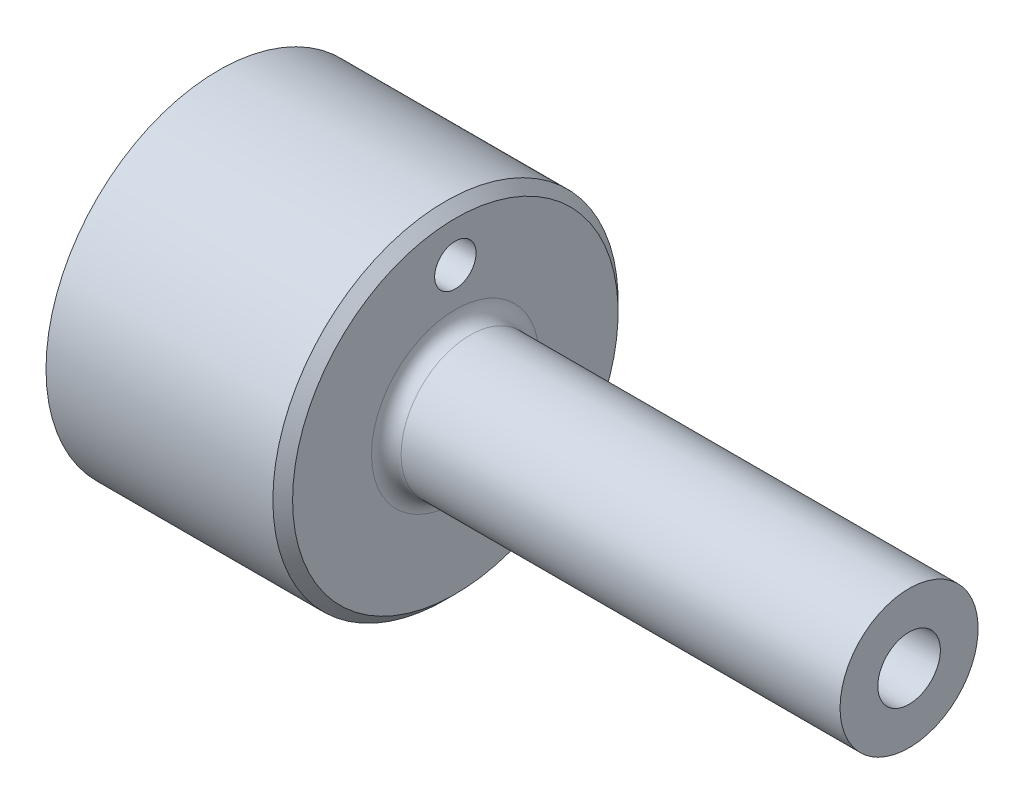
ISO-10303-21;
HEADER;
FILE_DESCRIPTION(('STEP AP214'),'2;1');
FILE_NAME('part.step','',(''),(''),'','','');
FILE_SCHEMA(('AUTOMOTIVE_DESIGN { 1 0 10303 214 1 1 1 1 }'));
ENDSEC;
DATA;
#1=APPLICATION_CONTEXT('core data for automotive mechanical design processes');
#2=APPLICATION_PROTOCOL_DEFINITION('international standard','automotive_design',2000,#1);
#3=PRODUCT_CONTEXT('',#1,'mechanical');
#4=PRODUCT('Part','Part','',(#3));
#5=PRODUCT_RELATED_PRODUCT_CATEGORY('part','',(#4));
#6=PRODUCT_DEFINITION_FORMATION('','',#4);
#7=PRODUCT_DEFINITION_CONTEXT('part definition',#1,'design');
#8=PRODUCT_DEFINITION('design','',#6,#7);
#9=PRODUCT_DEFINITION_SHAPE('','',#8);
#10=(LENGTH_UNIT() NAMED_UNIT(*) SI_UNIT(.MILLI.,.METRE.));
#11=(NAMED_UNIT(*) PLANE_ANGLE_UNIT() SI_UNIT($,.RADIAN.));
#12=(NAMED_UNIT(*) SI_UNIT($,.STERADIAN.) SOLID_ANGLE_UNIT());
#13=UNCERTAINTY_MEASURE_WITH_UNIT(LENGTH_MEASURE(1.E-05),#10,'distance_accuracy_value','');
#14=(GEOMETRIC_REPRESENTATION_CONTEXT(3) GLOBAL_UNCERTAINTY_ASSIGNED_CONTEXT((#13)) GLOBAL_UNIT_ASSIGNED_CONTEXT((#10,
#11,#12)) REPRESENTATION_CONTEXT('',''));
#15=CARTESIAN_POINT('',(0.,0.,0.));
#16=DIRECTION('',(0.,0.,1.));
#17=DIRECTION('',(1.,0.,0.));
#18=AXIS2_PLACEMENT_3D('',#15,#16,#17);
#19=CARTESIAN_POINT('',(25.5,0.,0.));
#20=DIRECTION('',(-1.,0.,0.));
#21=DIRECTION('',(0.,0.,1.));
#22=AXIS2_PLACEMENT_3D('',#19,#20,#21);
#23=TOROIDAL_SURFACE('',#22,8.5,1.5);
#24=CARTESIAN_POINT('',(24.,0.,0.));
#25=DIRECTION('',(-1.,0.,0.));
#26=DIRECTION('',(0.,0.,1.));
#27=AXIS2_PLACEMENT_3D('',#24,#25,#26);
#28=CIRCLE('',#27,8.5);
#29=CARTESIAN_POINT('',(24.,0.,8.5));
#30=VERTEX_POINT('',#29);
#31=EDGE_CURVE('E29',#30,#30,#28,.T.);
#32=ORIENTED_EDGE('',*,*,#31,.F.);
#33=EDGE_LOOP('',(#32));
#34=FACE_BOUND('',#33,.T.);
#35=CARTESIAN_POINT('',(25.5,0.,0.));
#36=DIRECTION('',(-1.,0.,0.));
#37=DIRECTION('',(0.,0.,1.));
#38=AXIS2_PLACEMENT_3D('',#35,#36,#37);
#39=CIRCLE('',#38,7.);
#40=CARTESIAN_POINT('',(25.5,0.,7.));
#41=VERTEX_POINT('',#40);
#42=EDGE_CURVE('E62',#41,#41,#39,.T.);
#43=ORIENTED_EDGE('',*,*,#42,.T.);
#44=EDGE_LOOP('',(#43));
#45=FACE_BOUND('',#44,.T.);
#46=ADVANCED_FACE('F13',(#34,#45),#23,.F.);
#47=CARTESIAN_POINT('',(24.,17.5,0.));
#48=DIRECTION('',(-1.,0.,0.));
#49=DIRECTION('',(0.,0.,1.));
#50=AXIS2_PLACEMENT_3D('',#47,#48,#49);
#51=PLANE('',#50);
#52=CARTESIAN_POINT('',(24.,0.,0.));
#53=DIRECTION('',(-1.,0.,0.));
#54=DIRECTION('',(0.,0.,1.));
#55=AXIS2_PLACEMENT_3D('',#52,#53,#54);
#56=CIRCLE('',#55,16.5);
#57=CARTESIAN_POINT('',(24.,0.,16.5));
#58=VERTEX_POINT('',#57);
#59=EDGE_CURVE('E8',#58,#58,#56,.F.);
#60=ORIENTED_EDGE('',*,*,#59,.T.);
#61=EDGE_LOOP('',(#60));
#62=FACE_BOUND('',#61,.T.);
#63=CARTESIAN_POINT('',(24.,12.4,0.));
#64=DIRECTION('',(-1.,0.,0.));
#65=DIRECTION('',(0.,0.,1.));
#66=AXIS2_PLACEMENT_3D('',#63,#64,#65);
#67=CIRCLE('',#66,2.1);
#68=CARTESIAN_POINT('',(24.,12.4,2.1));
#69=VERTEX_POINT('',#68);
#70=EDGE_CURVE('E38',#69,#69,#67,.T.);
#71=ORIENTED_EDGE('',*,*,#70,.T.);
#72=EDGE_LOOP('',(#71));
#73=FACE_BOUND('',#72,.T.);
#74=ORIENTED_EDGE('',*,*,#31,.T.);
#75=EDGE_LOOP('',(#74));
#76=FACE_BOUND('',#75,.T.);
#77=ADVANCED_FACE('F102',(#62,#73,#76),#51,.F.);
#78=CARTESIAN_POINT('',(0.,0.,0.));
#79=DIRECTION('',(-1.,0.,0.));
#80=DIRECTION('',(0.,0.,1.));
#81=AXIS2_PLACEMENT_3D('',#78,#79,#80);
#82=CYLINDRICAL_SURFACE('',#81,17.5);
#83=CARTESIAN_POINT('',(23.,0.,0.));
#84=DIRECTION('',(-1.,0.,0.));
#85=DIRECTION('',(0.,0.,1.));
#86=AXIS2_PLACEMENT_3D('',#83,#84,#85);
#87=CIRCLE('',#86,17.5);
#88=CARTESIAN_POINT('',(23.,0.,17.5));
#89=VERTEX_POINT('',#88);
#90=EDGE_CURVE('E21',#89,#89,#87,.T.);
#91=ORIENTED_EDGE('',*,*,#90,.T.);
#92=EDGE_LOOP('',(#91));
#93=FACE_BOUND('',#92,.T.);
#94=CARTESIAN_POINT('',(0.,0.,0.));
#95=DIRECTION('',(-1.,0.,0.));
#96=DIRECTION('',(0.,0.,1.));
#97=AXIS2_PLACEMENT_3D('',#94,#95,#96);
#98=CIRCLE('',#97,17.5);
#99=CARTESIAN_POINT('',(0.,0.,17.5));
#100=VERTEX_POINT('',#99);
#101=EDGE_CURVE('E35',#100,#100,#98,.T.);
#102=ORIENTED_EDGE('',*,*,#101,.F.);
#103=EDGE_LOOP('',(#102));
#104=FACE_BOUND('',#103,.T.);
#105=ADVANCED_FACE('F95',(#93,#104),#82,.T.);
#106=CARTESIAN_POINT('',(0.,4.10062261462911,0.));
#107=DIRECTION('',(1.,0.,0.));
#108=DIRECTION('',(0.,0.,-1.));
#109=AXIS2_PLACEMENT_3D('',#106,#107,#108);
#110=PLANE('',#109);
#111=CARTESIAN_POINT('',(0.,12.4,0.));
#112=DIRECTION('',(-1.,0.,0.));
#113=DIRECTION('',(0.,0.,1.));
#114=AXIS2_PLACEMENT_3D('',#111,#112,#113);
#115=CIRCLE('',#114,3.6);
#116=CARTESIAN_POINT('',(0.,12.4,3.6));
#117=VERTEX_POINT('',#116);
#118=EDGE_CURVE('E41',#117,#117,#115,.T.);
#119=ORIENTED_EDGE('',*,*,#118,.F.);
#120=EDGE_LOOP('',(#119));
#121=FACE_BOUND('',#120,.T.);
#122=CARTESIAN_POINT('',(0.,0.,0.));
#123=DIRECTION('',(-1.,0.,0.));
#124=DIRECTION('',(0.,0.,1.));
#125=AXIS2_PLACEMENT_3D('',#122,#123,#124);
#126=CIRCLE('',#125,4.10062261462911);
#127=CARTESIAN_POINT('',(0.,0.,4.10062261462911));
#128=VERTEX_POINT('',#127);
#129=EDGE_CURVE('E47',#128,#128,#126,.T.);
#130=ORIENTED_EDGE('',*,*,#129,.F.);
#131=EDGE_LOOP('',(#130));
#132=FACE_BOUND('',#131,.T.);
#133=ORIENTED_EDGE('',*,*,#101,.T.);
#134=EDGE_LOOP('',(#133));
#135=FACE_BOUND('',#134,.T.);
#136=ADVANCED_FACE('F91',(#121,#132,#135),#110,.F.);
#137=CARTESIAN_POINT('',(0.,0.,0.));
#138=DIRECTION('',(-1.,0.,0.));
#139=DIRECTION('',(0.,0.,1.));
#140=AXIS2_PLACEMENT_3D('',#137,#138,#139);
#141=CONICAL_SURFACE('',#140,4.10062261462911,0.610865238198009);
#142=CARTESIAN_POINT('',(3.,0.,0.));
#143=DIRECTION('',(-1.,0.,0.));
#144=DIRECTION('',(0.,0.,1.));
#145=AXIS2_PLACEMENT_3D('',#142,#143,#144);
#146=CIRCLE('',#145,2.);
#147=CARTESIAN_POINT('',(3.,0.,2.));
#148=VERTEX_POINT('',#147);
#149=EDGE_CURVE('E51',#148,#148,#146,.T.);
#150=ORIENTED_EDGE('',*,*,#149,.F.);
#151=EDGE_LOOP('',(#150));
#152=FACE_BOUND('',#151,.T.);
#153=ORIENTED_EDGE('',*,*,#129,.T.);
#154=EDGE_LOOP('',(#153));
#155=FACE_BOUND('',#154,.T.);
#156=ADVANCED_FACE('F94',(#152,#155),#141,.F.);
#157=CARTESIAN_POINT('',(3.,0.,0.));
#158=DIRECTION('',(1.,0.,0.));
#159=DIRECTION('',(0.,0.,-1.));
#160=AXIS2_PLACEMENT_3D('',#157,#158,#159);
#161=CONICAL_SURFACE('',#160,2.,0.0174532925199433);
#162=CARTESIAN_POINT('',(70.,0.,0.));
#163=DIRECTION('',(-1.,0.,0.));
#164=DIRECTION('',(0.,0.,1.));
#165=AXIS2_PLACEMENT_3D('',#162,#163,#164);
#166=CIRCLE('',#165,3.16948935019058);
#167=CARTESIAN_POINT('',(70.,0.,3.16948935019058));
#168=VERTEX_POINT('',#167);
#169=EDGE_CURVE('E55',#168,#168,#166,.T.);
#170=ORIENTED_EDGE('',*,*,#169,.F.);
#171=EDGE_LOOP('',(#170));
#172=FACE_BOUND('',#171,.T.);
#173=ORIENTED_EDGE('',*,*,#149,.T.);
#174=EDGE_LOOP('',(#173));
#175=FACE_BOUND('',#174,.T.);
#176=ADVANCED_FACE('F123',(#172,#175),#161,.F.);
#177=CARTESIAN_POINT('',(70.,7.,0.));
#178=DIRECTION('',(-1.,0.,0.));
#179=DIRECTION('',(0.,0.,1.));
#180=AXIS2_PLACEMENT_3D('',#177,#178,#179);
#181=PLANE('',#180);
#182=CARTESIAN_POINT('',(70.,0.,0.));
#183=DIRECTION('',(-1.,0.,0.));
#184=DIRECTION('',(0.,0.,1.));
#185=AXIS2_PLACEMENT_3D('',#182,#183,#184);
#186=CIRCLE('',#185,7.);
#187=CARTESIAN_POINT('',(70.,0.,7.));
#188=VERTEX_POINT('',#187);
#189=EDGE_CURVE('E58',#188,#188,#186,.T.);
#190=ORIENTED_EDGE('',*,*,#189,.F.);
#191=EDGE_LOOP('',(#190));
#192=FACE_BOUND('',#191,.T.);
#193=ORIENTED_EDGE('',*,*,#169,.T.);
#194=EDGE_LOOP('',(#193));
#195=FACE_BOUND('',#194,.T.);
#196=ADVANCED_FACE('F117',(#192,#195),#181,.F.);
#197=CARTESIAN_POINT('',(0.,0.,0.));
#198=DIRECTION('',(-1.,0.,0.));
#199=DIRECTION('',(0.,0.,1.));
#200=AXIS2_PLACEMENT_3D('',#197,#198,#199);
#201=CYLINDRICAL_SURFACE('',#200,7.);
#202=ORIENTED_EDGE('',*,*,#42,.F.);
#203=EDGE_LOOP('',(#202));
#204=FACE_BOUND('',#203,.T.);
#205=ORIENTED_EDGE('',*,*,#189,.T.);
#206=EDGE_LOOP('',(#205));
#207=FACE_BOUND('',#206,.T.);
#208=ADVANCED_FACE('F87',(#204,#207),#201,.T.);
#209=CARTESIAN_POINT('',(5.,12.4,0.));
#210=DIRECTION('',(-1.,0.,0.));
#211=DIRECTION('',(0.,0.,1.));
#212=AXIS2_PLACEMENT_3D('',#209,#210,#211);
#213=CYLINDRICAL_SURFACE('',#212,3.6);
#214=CARTESIAN_POINT('',(5.,12.4,0.));
#215=DIRECTION('',(-1.,0.,0.));
#216=DIRECTION('',(0.,0.,1.));
#217=AXIS2_PLACEMENT_3D('',#214,#215,#216);
#218=CIRCLE('',#217,3.6);
#219=CARTESIAN_POINT('',(5.,12.4,3.6));
#220=VERTEX_POINT('',#219);
#221=EDGE_CURVE('E66',#220,#220,#218,.T.);
#222=ORIENTED_EDGE('',*,*,#221,.F.);
#223=EDGE_LOOP('',(#222));
#224=FACE_BOUND('',#223,.T.);
#225=ORIENTED_EDGE('',*,*,#118,.T.);
#226=EDGE_LOOP('',(#225));
#227=FACE_BOUND('',#226,.T.);
#228=ADVANCED_FACE('F81',(#224,#227),#213,.F.);
#229=CARTESIAN_POINT('',(5.,12.4,0.));
#230=DIRECTION('',(-1.,0.,0.));
#231=DIRECTION('',(0.,0.,1.));
#232=AXIS2_PLACEMENT_3D('',#229,#230,#231);
#233=PLANE('',#232);
#234=CARTESIAN_POINT('',(5.,12.4,0.));
#235=DIRECTION('',(-1.,0.,0.));
#236=DIRECTION('',(0.,0.,1.));
#237=AXIS2_PLACEMENT_3D('',#234,#235,#236);
#238=CIRCLE('',#237,2.1);
#239=CARTESIAN_POINT('',(5.,12.4,2.1));
#240=VERTEX_POINT('',#239);
#241=EDGE_CURVE('E42',#240,#240,#238,.T.);
#242=ORIENTED_EDGE('',*,*,#241,.F.);
#243=EDGE_LOOP('',(#242));
#244=FACE_BOUND('',#243,.T.);
#245=ORIENTED_EDGE('',*,*,#221,.T.);
#246=EDGE_LOOP('',(#245));
#247=FACE_BOUND('',#246,.T.);
#248=ADVANCED_FACE('F78',(#244,#247),#233,.T.);
#249=CARTESIAN_POINT('',(70.,12.4,0.));
#250=DIRECTION('',(-1.,0.,0.));
#251=DIRECTION('',(0.,0.,1.));
#252=AXIS2_PLACEMENT_3D('',#249,#250,#251);
#253=CYLINDRICAL_SURFACE('',#252,2.1);
#254=ORIENTED_EDGE('',*,*,#241,.T.);
#255=EDGE_LOOP('',(#254));
#256=FACE_BOUND('',#255,.T.);
#257=ORIENTED_EDGE('',*,*,#70,.F.);
#258=EDGE_LOOP('',(#257));
#259=FACE_BOUND('',#258,.T.);
#260=ADVANCED_FACE('F75',(#256,#259),#253,.F.);
#261=CARTESIAN_POINT('',(23.,0.,0.));
#262=DIRECTION('',(-1.,0.,0.));
#263=DIRECTION('',(0.,0.,1.));
#264=AXIS2_PLACEMENT_3D('',#261,#262,#263);
#265=CONICAL_SURFACE('',#264,17.5,0.785398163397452);
#266=ORIENTED_EDGE('',*,*,#59,.F.);
#267=EDGE_LOOP('',(#266));
#268=FACE_BOUND('',#267,.T.);
#269=ORIENTED_EDGE('',*,*,#90,.F.);
#270=EDGE_LOOP('',(#269));
#271=FACE_BOUND('',#270,.T.);
#272=ADVANCED_FACE('F15',(#268,#271),#265,.T.);
#273=CLOSED_SHELL('',(#46,#77,#105,#136,#156,#176,#196,#208,#228,#248,#260,#272));
#274=MANIFOLD_SOLID_BREP('B1',#273);
#275=ADVANCED_BREP_SHAPE_REPRESENTATION('',(#18,#274),#14);
#276=SHAPE_DEFINITION_REPRESENTATION(#9,#275);
ENDSEC;
END-ISO-10303-21;
